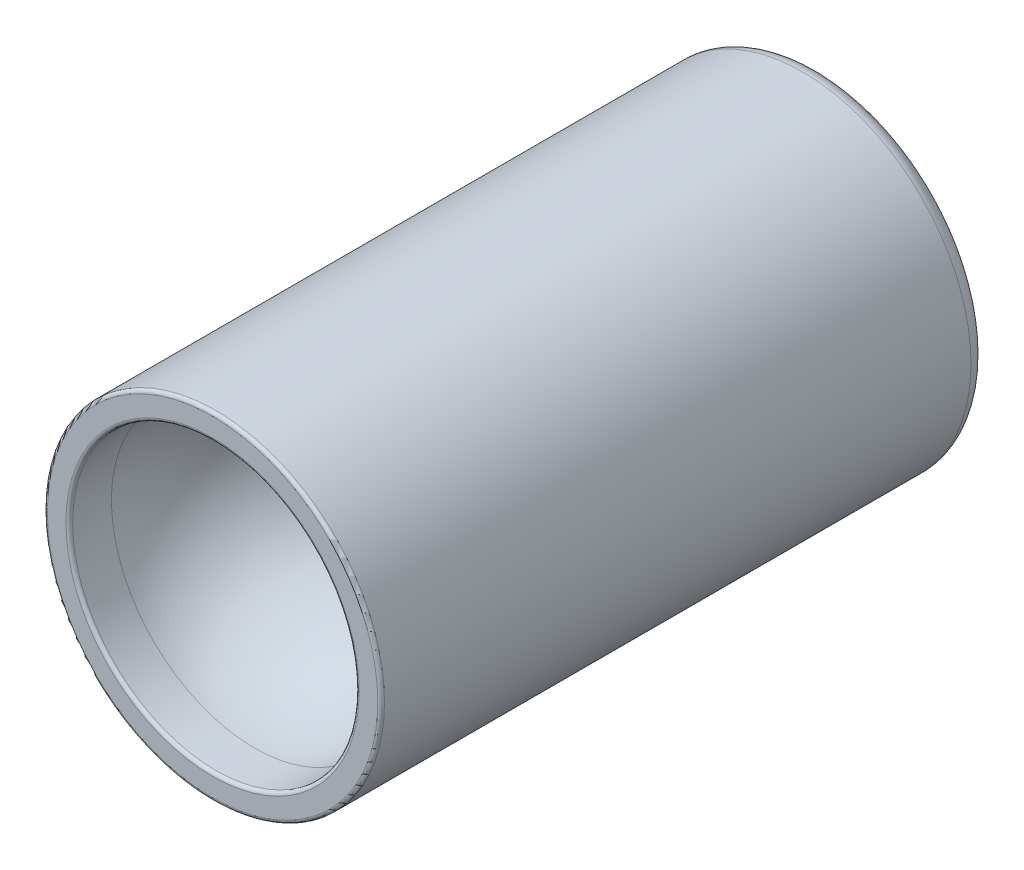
ISO-10303-21;
HEADER;
FILE_DESCRIPTION(('STEP AP214'),'2;1');
FILE_NAME('part.step','',(''),(''),'','','');
FILE_SCHEMA(('AUTOMOTIVE_DESIGN { 1 0 10303 214 1 1 1 1 }'));
ENDSEC;
DATA;
#1=APPLICATION_CONTEXT('core data for automotive mechanical design processes');
#2=APPLICATION_PROTOCOL_DEFINITION('international standard','automotive_design',2000,#1);
#3=PRODUCT_CONTEXT('',#1,'mechanical');
#4=PRODUCT('Part','Part','',(#3));
#5=PRODUCT_RELATED_PRODUCT_CATEGORY('part','',(#4));
#6=PRODUCT_DEFINITION_FORMATION('','',#4);
#7=PRODUCT_DEFINITION_CONTEXT('part definition',#1,'design');
#8=PRODUCT_DEFINITION('design','',#6,#7);
#9=PRODUCT_DEFINITION_SHAPE('','',#8);
#10=(LENGTH_UNIT() NAMED_UNIT(*) SI_UNIT(.MILLI.,.METRE.));
#11=(NAMED_UNIT(*) PLANE_ANGLE_UNIT() SI_UNIT($,.RADIAN.));
#12=(NAMED_UNIT(*) SI_UNIT($,.STERADIAN.) SOLID_ANGLE_UNIT());
#13=UNCERTAINTY_MEASURE_WITH_UNIT(LENGTH_MEASURE(1.E-05),#10,'distance_accuracy_value','');
#14=(GEOMETRIC_REPRESENTATION_CONTEXT(3) GLOBAL_UNCERTAINTY_ASSIGNED_CONTEXT((#13)) GLOBAL_UNIT_ASSIGNED_CONTEXT((#10,
#11,#12)) REPRESENTATION_CONTEXT('',''));
#15=CARTESIAN_POINT('',(0.,0.,0.));
#16=DIRECTION('',(0.,0.,1.));
#17=DIRECTION('',(1.,0.,0.));
#18=AXIS2_PLACEMENT_3D('',#15,#16,#17);
#19=CARTESIAN_POINT('',(0.,10.,0.));
#20=DIRECTION('',(0.,0.,-1.));
#21=DIRECTION('',(-1.,0.,0.));
#22=AXIS2_PLACEMENT_3D('',#19,#20,#21);
#23=PLANE('',#22);
#24=CARTESIAN_POINT('',(0.,0.,0.));
#25=DIRECTION('',(0.,0.,-1.));
#26=DIRECTION('',(-1.,0.,0.));
#27=AXIS2_PLACEMENT_3D('',#24,#25,#26);
#28=CIRCLE('',#27,8.7);
#29=CARTESIAN_POINT('',(-8.7,0.,0.));
#30=VERTEX_POINT('',#29);
#31=EDGE_CURVE('E52',#30,#30,#28,.T.);
#32=ORIENTED_EDGE('',*,*,#31,.T.);
#33=EDGE_LOOP('',(#32));
#34=FACE_BOUND('',#33,.T.);
#35=CARTESIAN_POINT('',(0.,0.,0.));
#36=DIRECTION('',(0.,0.,-1.));
#37=DIRECTION('',(-1.,0.,0.));
#38=AXIS2_PLACEMENT_3D('',#35,#36,#37);
#39=CIRCLE('',#38,9.8);
#40=CARTESIAN_POINT('',(-9.8,0.,0.));
#41=VERTEX_POINT('',#40);
#42=EDGE_CURVE('E55',#41,#41,#39,.F.);
#43=ORIENTED_EDGE('',*,*,#42,.T.);
#44=EDGE_LOOP('',(#43));
#45=FACE_BOUND('',#44,.T.);
#46=ADVANCED_FACE('F24',(#34,#45),#23,.F.);
#47=CARTESIAN_POINT('',(0.,0.,0.));
#48=DIRECTION('',(0.,0.,1.));
#49=DIRECTION('',(1.,0.,0.));
#50=AXIS2_PLACEMENT_3D('',#47,#48,#49);
#51=CYLINDRICAL_SURFACE('',#50,8.5);
#52=CARTESIAN_POINT('',(0.,0.,-0.2));
#53=DIRECTION('',(0.,0.,-1.));
#54=DIRECTION('',(-1.,0.,0.));
#55=AXIS2_PLACEMENT_3D('',#52,#53,#54);
#56=CIRCLE('',#55,8.5);
#57=CARTESIAN_POINT('',(-8.5,0.,-0.2));
#58=VERTEX_POINT('',#57);
#59=EDGE_CURVE('E58',#58,#58,#56,.F.);
#60=ORIENTED_EDGE('',*,*,#59,.T.);
#61=EDGE_LOOP('',(#60));
#62=FACE_BOUND('',#61,.T.);
#63=CARTESIAN_POINT('',(0.,0.,-2.5));
#64=DIRECTION('',(0.,0.,1.));
#65=DIRECTION('',(1.,0.,0.));
#66=AXIS2_PLACEMENT_3D('',#63,#64,#65);
#67=CIRCLE('',#66,8.5);
#68=CARTESIAN_POINT('',(8.5,0.,-2.5));
#69=VERTEX_POINT('',#68);
#70=EDGE_CURVE('E61',#69,#69,#67,.T.);
#71=ORIENTED_EDGE('',*,*,#70,.F.);
#72=EDGE_LOOP('',(#71));
#73=FACE_BOUND('',#72,.T.);
#74=ADVANCED_FACE('F94',(#62,#73),#51,.F.);
#75=CARTESIAN_POINT('',(0.,0.,-2.5));
#76=DIRECTION('',(0.,0.,1.));
#77=DIRECTION('',(0.,1.,0.));
#78=AXIS2_PLACEMENT_3D('',#75,#76,#77);
#79=SPHERICAL_SURFACE('',#78,8.5);
#80=CARTESIAN_POINT('',(0.,0.,-9.80393693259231));
#81=DIRECTION('',(0.,0.,1.));
#82=DIRECTION('',(1.,0.,0.));
#83=AXIS2_PLACEMENT_3D('',#80,#81,#82);
#84=CIRCLE('',#83,4.34770114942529);
#85=CARTESIAN_POINT('',(4.34770114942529,0.,-9.80393693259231));
#86=VERTEX_POINT('',#85);
#87=EDGE_CURVE('E43',#86,#86,#84,.F.);
#88=ORIENTED_EDGE('',*,*,#87,.T.);
#89=EDGE_LOOP('',(#88));
#90=FACE_BOUND('',#89,.T.);
#91=ORIENTED_EDGE('',*,*,#70,.T.);
#92=EDGE_LOOP('',(#91));
#93=FACE_BOUND('',#92,.T.);
#94=ADVANCED_FACE('F99',(#90,#93),#79,.F.);
#95=CARTESIAN_POINT('',(0.,0.,0.));
#96=DIRECTION('',(0.,0.,1.));
#97=DIRECTION('',(1.,0.,0.));
#98=AXIS2_PLACEMENT_3D('',#95,#96,#97);
#99=CYLINDRICAL_SURFACE('',#98,4.25);
#100=CARTESIAN_POINT('',(0.,0.,-9.97579427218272));
#101=DIRECTION('',(0.,0.,1.));
#102=DIRECTION('',(1.,0.,0.));
#103=AXIS2_PLACEMENT_3D('',#100,#101,#102);
#104=CIRCLE('',#103,4.25);
#105=CARTESIAN_POINT('',(4.25,0.,-9.97579427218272));
#106=VERTEX_POINT('',#105);
#107=EDGE_CURVE('E46',#106,#106,#104,.T.);
#108=ORIENTED_EDGE('',*,*,#107,.T.);
#109=EDGE_LOOP('',(#108));
#110=FACE_BOUND('',#109,.T.);
#111=CARTESIAN_POINT('',(0.,0.,-19.5242057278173));
#112=DIRECTION('',(0.,0.,-1.));
#113=DIRECTION('',(-1.,0.,0.));
#114=AXIS2_PLACEMENT_3D('',#111,#112,#113);
#115=CIRCLE('',#114,4.25);
#116=CARTESIAN_POINT('',(-4.25,0.,-19.5242057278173));
#117=VERTEX_POINT('',#116);
#118=EDGE_CURVE('E49',#117,#117,#115,.T.);
#119=ORIENTED_EDGE('',*,*,#118,.T.);
#120=EDGE_LOOP('',(#119));
#121=FACE_BOUND('',#120,.T.);
#122=ADVANCED_FACE('F165',(#110,#121),#99,.F.);
#123=CARTESIAN_POINT('',(0.,0.,-27.));
#124=DIRECTION('',(0.,0.,1.));
#125=DIRECTION('',(0.,1.,0.));
#126=AXIS2_PLACEMENT_3D('',#123,#124,#125);
#127=SPHERICAL_SURFACE('',#126,8.5);
#128=CARTESIAN_POINT('',(0.,0.,-19.6960630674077));
#129=DIRECTION('',(0.,0.,-1.));
#130=DIRECTION('',(-1.,0.,0.));
#131=AXIS2_PLACEMENT_3D('',#128,#129,#130);
#132=CIRCLE('',#131,4.34770114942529);
#133=CARTESIAN_POINT('',(-4.34770114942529,0.,-19.6960630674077));
#134=VERTEX_POINT('',#133);
#135=EDGE_CURVE('E38',#134,#134,#132,.F.);
#136=ORIENTED_EDGE('',*,*,#135,.T.);
#137=EDGE_LOOP('',(#136));
#138=FACE_BOUND('',#137,.T.);
#139=CARTESIAN_POINT('',(0.,0.,-27.));
#140=DIRECTION('',(0.,0.,1.));
#141=DIRECTION('',(1.,0.,0.));
#142=AXIS2_PLACEMENT_3D('',#139,#140,#141);
#143=CIRCLE('',#142,8.5);
#144=CARTESIAN_POINT('',(8.5,0.,-27.));
#145=VERTEX_POINT('',#144);
#146=EDGE_CURVE('E64',#145,#145,#143,.T.);
#147=ORIENTED_EDGE('',*,*,#146,.F.);
#148=EDGE_LOOP('',(#147));
#149=FACE_BOUND('',#148,.T.);
#150=ADVANCED_FACE('F91',(#138,#149),#127,.F.);
#151=CARTESIAN_POINT('',(0.,0.,0.));
#152=DIRECTION('',(0.,0.,1.));
#153=DIRECTION('',(1.,0.,0.));
#154=AXIS2_PLACEMENT_3D('',#151,#152,#153);
#155=CYLINDRICAL_SURFACE('',#154,8.5);
#156=CARTESIAN_POINT('',(0.,0.,-35.8));
#157=DIRECTION('',(0.,0.,1.));
#158=DIRECTION('',(1.,0.,0.));
#159=AXIS2_PLACEMENT_3D('',#156,#157,#158);
#160=CIRCLE('',#159,8.5);
#161=CARTESIAN_POINT('',(8.5,0.,-35.8));
#162=VERTEX_POINT('',#161);
#163=EDGE_CURVE('E30',#162,#162,#160,.F.);
#164=ORIENTED_EDGE('',*,*,#163,.T.);
#165=EDGE_LOOP('',(#164));
#166=FACE_BOUND('',#165,.T.);
#167=ORIENTED_EDGE('',*,*,#146,.T.);
#168=EDGE_LOOP('',(#167));
#169=FACE_BOUND('',#168,.T.);
#170=ADVANCED_FACE('F84',(#166,#169),#155,.F.);
#171=CARTESIAN_POINT('',(0.,8.99999999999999,-36.));
#172=DIRECTION('',(0.,0.,1.));
#173=DIRECTION('',(1.,0.,0.));
#174=AXIS2_PLACEMENT_3D('',#171,#172,#173);
#175=PLANE('',#174);
#176=CARTESIAN_POINT('',(0.,0.,-36.));
#177=DIRECTION('',(0.,0.,1.));
#178=DIRECTION('',(1.,0.,0.));
#179=AXIS2_PLACEMENT_3D('',#176,#177,#178);
#180=CIRCLE('',#179,8.7);
#181=CARTESIAN_POINT('',(8.7,0.,-36.));
#182=VERTEX_POINT('',#181);
#183=EDGE_CURVE('E34',#182,#182,#180,.T.);
#184=ORIENTED_EDGE('',*,*,#183,.T.);
#185=EDGE_LOOP('',(#184));
#186=FACE_BOUND('',#185,.T.);
#187=CARTESIAN_POINT('',(0.,0.,-36.));
#188=DIRECTION('',(0.,0.,1.));
#189=DIRECTION('',(1.,0.,0.));
#190=AXIS2_PLACEMENT_3D('',#187,#188,#189);
#191=CIRCLE('',#190,8.99999999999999);
#192=CARTESIAN_POINT('',(8.99999999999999,0.,-36.));
#193=VERTEX_POINT('',#192);
#194=EDGE_CURVE('E67',#193,#193,#191,.T.);
#195=ORIENTED_EDGE('',*,*,#194,.F.);
#196=EDGE_LOOP('',(#195));
#197=FACE_BOUND('',#196,.T.);
#198=ADVANCED_FACE('F79',(#186,#197),#175,.F.);
#199=CARTESIAN_POINT('',(0.,0.,-35.));
#200=DIRECTION('',(0.,0.,1.));
#201=DIRECTION('',(1.,0.,0.));
#202=AXIS2_PLACEMENT_3D('',#199,#200,#201);
#203=TOROIDAL_SURFACE('',#202,9.,1.);
#204=CARTESIAN_POINT('',(0.,0.,-35.));
#205=DIRECTION('',(0.,0.,1.));
#206=DIRECTION('',(1.,0.,0.));
#207=AXIS2_PLACEMENT_3D('',#204,#205,#206);
#208=CIRCLE('',#207,10.);
#209=CARTESIAN_POINT('',(10.,0.,-35.));
#210=VERTEX_POINT('',#209);
#211=EDGE_CURVE('E70',#210,#210,#208,.T.);
#212=ORIENTED_EDGE('',*,*,#211,.F.);
#213=EDGE_LOOP('',(#212));
#214=FACE_BOUND('',#213,.T.);
#215=ORIENTED_EDGE('',*,*,#194,.T.);
#216=EDGE_LOOP('',(#215));
#217=FACE_BOUND('',#216,.T.);
#218=ADVANCED_FACE('F76',(#214,#217),#203,.T.);
#219=CARTESIAN_POINT('',(0.,0.,0.));
#220=DIRECTION('',(0.,0.,1.));
#221=DIRECTION('',(1.,0.,0.));
#222=AXIS2_PLACEMENT_3D('',#219,#220,#221);
#223=CYLINDRICAL_SURFACE('',#222,10.);
#224=CARTESIAN_POINT('',(0.,0.,-0.2));
#225=DIRECTION('',(0.,0.,-1.));
#226=DIRECTION('',(-1.,0.,0.));
#227=AXIS2_PLACEMENT_3D('',#224,#225,#226);
#228=CIRCLE('',#227,10.);
#229=CARTESIAN_POINT('',(-10.,0.,-0.2));
#230=VERTEX_POINT('',#229);
#231=EDGE_CURVE('E10',#230,#230,#228,.T.);
#232=ORIENTED_EDGE('',*,*,#231,.T.);
#233=EDGE_LOOP('',(#232));
#234=FACE_BOUND('',#233,.T.);
#235=ORIENTED_EDGE('',*,*,#211,.T.);
#236=EDGE_LOOP('',(#235));
#237=FACE_BOUND('',#236,.T.);
#238=ADVANCED_FACE('F74',(#234,#237),#223,.T.);
#239=CARTESIAN_POINT('',(0.,0.,-0.2));
#240=DIRECTION('',(0.,0.,-1.));
#241=DIRECTION('',(-1.,0.,0.));
#242=AXIS2_PLACEMENT_3D('',#239,#240,#241);
#243=TOROIDAL_SURFACE('',#242,8.7,0.2);
#244=ORIENTED_EDGE('',*,*,#31,.F.);
#245=EDGE_LOOP('',(#244));
#246=FACE_BOUND('',#245,.T.);
#247=ORIENTED_EDGE('',*,*,#59,.F.);
#248=EDGE_LOOP('',(#247));
#249=FACE_BOUND('',#248,.T.);
#250=ADVANCED_FACE('F123',(#246,#249),#243,.T.);
#251=CARTESIAN_POINT('',(0.,0.,-9.97579427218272));
#252=DIRECTION('',(0.,0.,1.));
#253=DIRECTION('',(1.,0.,0.));
#254=AXIS2_PLACEMENT_3D('',#251,#252,#253);
#255=TOROIDAL_SURFACE('',#254,4.45,0.2);
#256=ORIENTED_EDGE('',*,*,#87,.F.);
#257=EDGE_LOOP('',(#256));
#258=FACE_BOUND('',#257,.T.);
#259=ORIENTED_EDGE('',*,*,#107,.F.);
#260=EDGE_LOOP('',(#259));
#261=FACE_BOUND('',#260,.T.);
#262=ADVANCED_FACE('F119',(#258,#261),#255,.T.);
#263=CARTESIAN_POINT('',(0.,0.,-19.5242057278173));
#264=DIRECTION('',(0.,0.,-1.));
#265=DIRECTION('',(-1.,0.,0.));
#266=AXIS2_PLACEMENT_3D('',#263,#264,#265);
#267=TOROIDAL_SURFACE('',#266,4.45,0.2);
#268=ORIENTED_EDGE('',*,*,#118,.F.);
#269=EDGE_LOOP('',(#268));
#270=FACE_BOUND('',#269,.T.);
#271=ORIENTED_EDGE('',*,*,#135,.F.);
#272=EDGE_LOOP('',(#271));
#273=FACE_BOUND('',#272,.T.);
#274=ADVANCED_FACE('F113',(#270,#273),#267,.T.);
#275=CARTESIAN_POINT('',(0.,0.,-35.8));
#276=DIRECTION('',(0.,0.,1.));
#277=DIRECTION('',(1.,0.,0.));
#278=AXIS2_PLACEMENT_3D('',#275,#276,#277);
#279=TOROIDAL_SURFACE('',#278,8.7,0.2);
#280=ORIENTED_EDGE('',*,*,#163,.F.);
#281=EDGE_LOOP('',(#280));
#282=FACE_BOUND('',#281,.T.);
#283=ORIENTED_EDGE('',*,*,#183,.F.);
#284=EDGE_LOOP('',(#283));
#285=FACE_BOUND('',#284,.T.);
#286=ADVANCED_FACE('F107',(#282,#285),#279,.T.);
#287=CARTESIAN_POINT('',(0.,0.,-0.2));
#288=DIRECTION('',(0.,0.,-1.));
#289=DIRECTION('',(-1.,0.,0.));
#290=AXIS2_PLACEMENT_3D('',#287,#288,#289);
#291=TOROIDAL_SURFACE('',#290,9.8,0.2);
#292=ORIENTED_EDGE('',*,*,#231,.F.);
#293=EDGE_LOOP('',(#292));
#294=FACE_BOUND('',#293,.T.);
#295=ORIENTED_EDGE('',*,*,#42,.F.);
#296=EDGE_LOOP('',(#295));
#297=FACE_BOUND('',#296,.T.);
#298=ADVANCED_FACE('F105',(#294,#297),#291,.T.);
#299=CLOSED_SHELL('',(#46,#74,#94,#122,#150,#170,#198,#218,#238,#250,#262,#274,#286,#298));
#300=MANIFOLD_SOLID_BREP('B2',#299);
#301=ADVANCED_BREP_SHAPE_REPRESENTATION('',(#18,#300),#14);
#302=SHAPE_DEFINITION_REPRESENTATION(#9,#301);
ENDSEC;
END-ISO-10303-21;
